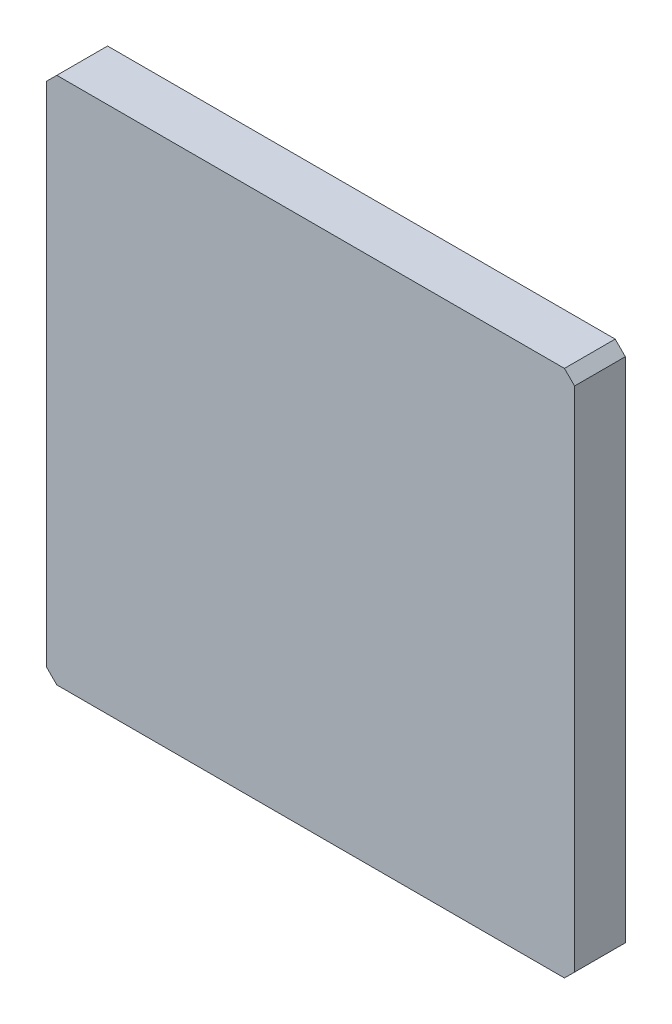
ISO-10303-21;
HEADER;
FILE_DESCRIPTION(('STEP AP214'),'2;1');
FILE_NAME('part.step','',(''),(''),'','','');
FILE_SCHEMA(('AUTOMOTIVE_DESIGN { 1 0 10303 214 1 1 1 1 }'));
ENDSEC;
DATA;
#1=APPLICATION_CONTEXT('core data for automotive mechanical design processes');
#2=APPLICATION_PROTOCOL_DEFINITION('international standard','automotive_design',2000,#1);
#3=PRODUCT_CONTEXT('',#1,'mechanical');
#4=PRODUCT('Part','Part','',(#3));
#5=PRODUCT_RELATED_PRODUCT_CATEGORY('part','',(#4));
#6=PRODUCT_DEFINITION_FORMATION('','',#4);
#7=PRODUCT_DEFINITION_CONTEXT('part definition',#1,'design');
#8=PRODUCT_DEFINITION('design','',#6,#7);
#9=PRODUCT_DEFINITION_SHAPE('','',#8);
#10=(LENGTH_UNIT() NAMED_UNIT(*) SI_UNIT(.MILLI.,.METRE.));
#11=(NAMED_UNIT(*) PLANE_ANGLE_UNIT() SI_UNIT($,.RADIAN.));
#12=(NAMED_UNIT(*) SI_UNIT($,.STERADIAN.) SOLID_ANGLE_UNIT());
#13=UNCERTAINTY_MEASURE_WITH_UNIT(LENGTH_MEASURE(1.E-05),#10,'distance_accuracy_value','');
#14=(GEOMETRIC_REPRESENTATION_CONTEXT(3) GLOBAL_UNCERTAINTY_ASSIGNED_CONTEXT((#13)) GLOBAL_UNIT_ASSIGNED_CONTEXT((#10,
#11,#12)) REPRESENTATION_CONTEXT('',''));
#15=CARTESIAN_POINT('',(0.,0.,0.));
#16=DIRECTION('',(0.,0.,1.));
#17=DIRECTION('',(1.,0.,0.));
#18=AXIS2_PLACEMENT_3D('',#15,#16,#17);
#19=CARTESIAN_POINT('',(2.6,2.6,0.5));
#20=DIRECTION('',(-1.,0.,0.));
#21=DIRECTION('',(0.,-1.,0.));
#22=AXIS2_PLACEMENT_3D('',#19,#20,#21);
#23=PLANE('',#22);
#24=DIRECTION('',(0.,1.,0.));
#25=VECTOR('',#24,1.);
#26=CARTESIAN_POINT('',(2.6,2.6,0.5));
#27=LINE('',#26,#25);
#28=CARTESIAN_POINT('',(2.6,-2.5,0.5));
#29=VERTEX_POINT('',#28);
#30=CARTESIAN_POINT('',(2.6,2.5,0.5));
#31=VERTEX_POINT('',#30);
#32=EDGE_CURVE('E146',#29,#31,#27,.T.);
#33=ORIENTED_EDGE('',*,*,#32,.F.);
#34=DIRECTION('',(0.,0.,-1.));
#35=VECTOR('',#34,1.);
#36=CARTESIAN_POINT('',(2.6,-2.5,0.5));
#37=LINE('',#36,#35);
#38=CARTESIAN_POINT('',(2.6,-2.5,0.));
#39=VERTEX_POINT('',#38);
#40=EDGE_CURVE('E11',#29,#39,#37,.T.);
#41=ORIENTED_EDGE('',*,*,#40,.T.);
#42=DIRECTION('',(0.,1.,0.));
#43=VECTOR('',#42,1.);
#44=CARTESIAN_POINT('',(2.6,2.6,0.));
#45=LINE('',#44,#43);
#46=CARTESIAN_POINT('',(2.6,2.5,0.));
#47=VERTEX_POINT('',#46);
#48=EDGE_CURVE('E192',#39,#47,#45,.T.);
#49=ORIENTED_EDGE('',*,*,#48,.T.);
#50=DIRECTION('',(0.,0.,1.));
#51=VECTOR('',#50,1.);
#52=CARTESIAN_POINT('',(2.6,2.5,0.5));
#53=LINE('',#52,#51);
#54=EDGE_CURVE('E57',#47,#31,#53,.T.);
#55=ORIENTED_EDGE('',*,*,#54,.T.);
#56=EDGE_LOOP('',(#33,#41,#49,#55));
#57=FACE_BOUND('',#56,.T.);
#58=ADVANCED_FACE('F47',(#57),#23,.F.);
#59=CARTESIAN_POINT('',(-2.6,2.6,0.5));
#60=DIRECTION('',(0.,-1.,0.));
#61=DIRECTION('',(0.,0.,-1.));
#62=AXIS2_PLACEMENT_3D('',#59,#60,#61);
#63=PLANE('',#62);
#64=DIRECTION('',(-1.,0.,0.));
#65=VECTOR('',#64,1.);
#66=CARTESIAN_POINT('',(-2.6,2.6,0.));
#67=LINE('',#66,#65);
#68=CARTESIAN_POINT('',(2.5,2.6,0.));
#69=VERTEX_POINT('',#68);
#70=CARTESIAN_POINT('',(-2.5,2.6,0.));
#71=VERTEX_POINT('',#70);
#72=EDGE_CURVE('E153',#69,#71,#67,.T.);
#73=ORIENTED_EDGE('',*,*,#72,.T.);
#74=DIRECTION('',(0.,0.,1.));
#75=VECTOR('',#74,1.);
#76=CARTESIAN_POINT('',(-2.5,2.6,0.5));
#77=LINE('',#76,#75);
#78=CARTESIAN_POINT('',(-2.5,2.6,0.5));
#79=VERTEX_POINT('',#78);
#80=EDGE_CURVE('E64',#71,#79,#77,.T.);
#81=ORIENTED_EDGE('',*,*,#80,.T.);
#82=DIRECTION('',(-1.,0.,0.));
#83=VECTOR('',#82,1.);
#84=CARTESIAN_POINT('',(-2.6,2.6,0.5));
#85=LINE('',#84,#83);
#86=CARTESIAN_POINT('',(2.5,2.6,0.5));
#87=VERTEX_POINT('',#86);
#88=EDGE_CURVE('E151',#87,#79,#85,.T.);
#89=ORIENTED_EDGE('',*,*,#88,.F.);
#90=DIRECTION('',(0.,0.,-1.));
#91=VECTOR('',#90,1.);
#92=CARTESIAN_POINT('',(2.5,2.6,0.5));
#93=LINE('',#92,#91);
#94=EDGE_CURVE('E181',#87,#69,#93,.T.);
#95=ORIENTED_EDGE('',*,*,#94,.T.);
#96=EDGE_LOOP('',(#73,#81,#89,#95));
#97=FACE_BOUND('',#96,.T.);
#98=ADVANCED_FACE('F199',(#97),#63,.F.);
#99=CARTESIAN_POINT('',(-2.6,2.6,0.5));
#100=DIRECTION('',(1.,0.,0.));
#101=DIRECTION('',(0.,1.,0.));
#102=AXIS2_PLACEMENT_3D('',#99,#100,#101);
#103=PLANE('',#102);
#104=DIRECTION('',(0.,-1.,0.));
#105=VECTOR('',#104,1.);
#106=CARTESIAN_POINT('',(-2.6,2.6,0.));
#107=LINE('',#106,#105);
#108=CARTESIAN_POINT('',(-2.6,2.5,0.));
#109=VERTEX_POINT('',#108);
#110=CARTESIAN_POINT('',(-2.6,-2.5,0.));
#111=VERTEX_POINT('',#110);
#112=EDGE_CURVE('E147',#109,#111,#107,.T.);
#113=ORIENTED_EDGE('',*,*,#112,.T.);
#114=DIRECTION('',(0.,0.,1.));
#115=VECTOR('',#114,1.);
#116=CARTESIAN_POINT('',(-2.6,-2.5,0.5));
#117=LINE('',#116,#115);
#118=CARTESIAN_POINT('',(-2.6,-2.5,0.5));
#119=VERTEX_POINT('',#118);
#120=EDGE_CURVE('E121',#111,#119,#117,.T.);
#121=ORIENTED_EDGE('',*,*,#120,.T.);
#122=DIRECTION('',(0.,-1.,0.));
#123=VECTOR('',#122,1.);
#124=CARTESIAN_POINT('',(-2.6,2.6,0.5));
#125=LINE('',#124,#123);
#126=CARTESIAN_POINT('',(-2.6,2.5,0.5));
#127=VERTEX_POINT('',#126);
#128=EDGE_CURVE('E206',#127,#119,#125,.T.);
#129=ORIENTED_EDGE('',*,*,#128,.F.);
#130=DIRECTION('',(0.,0.,-1.));
#131=VECTOR('',#130,1.);
#132=CARTESIAN_POINT('',(-2.6,2.5,0.5));
#133=LINE('',#132,#131);
#134=EDGE_CURVE('E127',#127,#109,#133,.T.);
#135=ORIENTED_EDGE('',*,*,#134,.T.);
#136=EDGE_LOOP('',(#113,#121,#129,#135));
#137=FACE_BOUND('',#136,.T.);
#138=ADVANCED_FACE('F216',(#137),#103,.F.);
#139=CARTESIAN_POINT('',(-2.6,-2.6,0.5));
#140=DIRECTION('',(0.,1.,0.));
#141=DIRECTION('',(0.,0.,1.));
#142=AXIS2_PLACEMENT_3D('',#139,#140,#141);
#143=PLANE('',#142);
#144=DIRECTION('',(1.,0.,0.));
#145=VECTOR('',#144,1.);
#146=CARTESIAN_POINT('',(-2.6,-2.6,0.5));
#147=LINE('',#146,#145);
#148=CARTESIAN_POINT('',(-2.5,-2.6,0.5));
#149=VERTEX_POINT('',#148);
#150=CARTESIAN_POINT('',(2.5,-2.6,0.5));
#151=VERTEX_POINT('',#150);
#152=EDGE_CURVE('E137',#149,#151,#147,.T.);
#153=ORIENTED_EDGE('',*,*,#152,.F.);
#154=DIRECTION('',(0.,0.,-1.));
#155=VECTOR('',#154,1.);
#156=CARTESIAN_POINT('',(-2.5,-2.6,0.5));
#157=LINE('',#156,#155);
#158=CARTESIAN_POINT('',(-2.5,-2.6,0.));
#159=VERTEX_POINT('',#158);
#160=EDGE_CURVE('E120',#149,#159,#157,.T.);
#161=ORIENTED_EDGE('',*,*,#160,.T.);
#162=DIRECTION('',(1.,0.,0.));
#163=VECTOR('',#162,1.);
#164=CARTESIAN_POINT('',(-2.6,-2.6,0.));
#165=LINE('',#164,#163);
#166=CARTESIAN_POINT('',(2.5,-2.6,0.));
#167=VERTEX_POINT('',#166);
#168=EDGE_CURVE('E134',#159,#167,#165,.T.);
#169=ORIENTED_EDGE('',*,*,#168,.T.);
#170=DIRECTION('',(0.,0.,1.));
#171=VECTOR('',#170,1.);
#172=CARTESIAN_POINT('',(2.5,-2.6,0.5));
#173=LINE('',#172,#171);
#174=EDGE_CURVE('E140',#167,#151,#173,.T.);
#175=ORIENTED_EDGE('',*,*,#174,.T.);
#176=EDGE_LOOP('',(#153,#161,#169,#175));
#177=FACE_BOUND('',#176,.T.);
#178=ADVANCED_FACE('F133',(#177),#143,.F.);
#179=CARTESIAN_POINT('',(0.,0.,0.5));
#180=DIRECTION('',(0.,0.,1.));
#181=DIRECTION('',(1.,0.,0.));
#182=AXIS2_PLACEMENT_3D('',#179,#180,#181);
#183=PLANE('',#182);
#184=ORIENTED_EDGE('',*,*,#128,.T.);
#185=DIRECTION('',(-0.707106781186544,0.707106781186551,0.));
#186=VECTOR('',#185,1.);
#187=CARTESIAN_POINT('',(-2.55000000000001,-2.54999999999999,0.5));
#188=LINE('',#187,#186);
#189=EDGE_CURVE('E178',#119,#149,#188,.F.);
#190=ORIENTED_EDGE('',*,*,#189,.T.);
#191=ORIENTED_EDGE('',*,*,#152,.T.);
#192=DIRECTION('',(-0.707106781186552,-0.707106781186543,0.));
#193=VECTOR('',#192,1.);
#194=CARTESIAN_POINT('',(2.54999999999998,-2.55000000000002,0.5));
#195=LINE('',#194,#193);
#196=EDGE_CURVE('E172',#151,#29,#195,.F.);
#197=ORIENTED_EDGE('',*,*,#196,.T.);
#198=ORIENTED_EDGE('',*,*,#32,.T.);
#199=DIRECTION('',(0.707106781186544,-0.707106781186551,0.));
#200=VECTOR('',#199,1.);
#201=CARTESIAN_POINT('',(2.55000000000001,2.54999999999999,0.5));
#202=LINE('',#201,#200);
#203=EDGE_CURVE('E71',#31,#87,#202,.F.);
#204=ORIENTED_EDGE('',*,*,#203,.T.);
#205=ORIENTED_EDGE('',*,*,#88,.T.);
#206=DIRECTION('',(0.707106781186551,0.707106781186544,0.));
#207=VECTOR('',#206,1.);
#208=CARTESIAN_POINT('',(-2.54999999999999,2.55000000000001,0.5));
#209=LINE('',#208,#207);
#210=EDGE_CURVE('E175',#79,#127,#209,.F.);
#211=ORIENTED_EDGE('',*,*,#210,.T.);
#212=EDGE_LOOP('',(#184,#190,#191,#197,#198,#204,#205,#211));
#213=FACE_BOUND('',#212,.T.);
#214=ADVANCED_FACE('F195',(#213),#183,.T.);
#215=CARTESIAN_POINT('',(0.,0.,0.));
#216=DIRECTION('',(0.,0.,1.));
#217=DIRECTION('',(1.,0.,0.));
#218=AXIS2_PLACEMENT_3D('',#215,#216,#217);
#219=PLANE('',#218);
#220=ORIENTED_EDGE('',*,*,#168,.F.);
#221=DIRECTION('',(0.707106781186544,-0.707106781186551,0.));
#222=VECTOR('',#221,1.);
#223=CARTESIAN_POINT('',(-2.5,-2.6,0.));
#224=LINE('',#223,#222);
#225=EDGE_CURVE('E116',#159,#111,#224,.F.);
#226=ORIENTED_EDGE('',*,*,#225,.T.);
#227=ORIENTED_EDGE('',*,*,#112,.F.);
#228=DIRECTION('',(-0.707106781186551,-0.707106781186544,0.));
#229=VECTOR('',#228,1.);
#230=CARTESIAN_POINT('',(-2.6,2.5,0.));
#231=LINE('',#230,#229);
#232=EDGE_CURVE('E128',#109,#71,#231,.F.);
#233=ORIENTED_EDGE('',*,*,#232,.T.);
#234=ORIENTED_EDGE('',*,*,#72,.F.);
#235=DIRECTION('',(-0.707106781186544,0.707106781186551,0.));
#236=VECTOR('',#235,1.);
#237=CARTESIAN_POINT('',(2.5,2.6,0.));
#238=LINE('',#237,#236);
#239=EDGE_CURVE('E139',#69,#47,#238,.F.);
#240=ORIENTED_EDGE('',*,*,#239,.T.);
#241=ORIENTED_EDGE('',*,*,#48,.F.);
#242=DIRECTION('',(0.707106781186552,0.707106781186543,0.));
#243=VECTOR('',#242,1.);
#244=CARTESIAN_POINT('',(2.6,-2.5,0.));
#245=LINE('',#244,#243);
#246=EDGE_CURVE('E144',#39,#167,#245,.F.);
#247=ORIENTED_EDGE('',*,*,#246,.T.);
#248=EDGE_LOOP('',(#220,#226,#227,#233,#234,#240,#241,#247));
#249=FACE_BOUND('',#248,.T.);
#250=ADVANCED_FACE('F142',(#249),#219,.F.);
#251=CARTESIAN_POINT('',(-2.5,-2.6,0.5));
#252=DIRECTION('',(0.707106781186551,0.707106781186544,0.));
#253=DIRECTION('',(0.,0.,-1.));
#254=AXIS2_PLACEMENT_3D('',#251,#252,#253);
#255=PLANE('',#254);
#256=ORIENTED_EDGE('',*,*,#189,.F.);
#257=ORIENTED_EDGE('',*,*,#120,.F.);
#258=ORIENTED_EDGE('',*,*,#225,.F.);
#259=ORIENTED_EDGE('',*,*,#160,.F.);
#260=EDGE_LOOP('',(#256,#257,#258,#259));
#261=FACE_BOUND('',#260,.T.);
#262=ADVANCED_FACE('F119',(#261),#255,.F.);
#263=CARTESIAN_POINT('',(-2.6,2.5,0.5));
#264=DIRECTION('',(0.707106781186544,-0.707106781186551,0.));
#265=DIRECTION('',(0.,0.,-1.));
#266=AXIS2_PLACEMENT_3D('',#263,#264,#265);
#267=PLANE('',#266);
#268=ORIENTED_EDGE('',*,*,#210,.F.);
#269=ORIENTED_EDGE('',*,*,#80,.F.);
#270=ORIENTED_EDGE('',*,*,#232,.F.);
#271=ORIENTED_EDGE('',*,*,#134,.F.);
#272=EDGE_LOOP('',(#268,#269,#270,#271));
#273=FACE_BOUND('',#272,.T.);
#274=ADVANCED_FACE('F214',(#273),#267,.F.);
#275=CARTESIAN_POINT('',(2.6,-2.5,0.5));
#276=DIRECTION('',(-0.707106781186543,0.707106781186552,0.));
#277=DIRECTION('',(0.,0.,-1.));
#278=AXIS2_PLACEMENT_3D('',#275,#276,#277);
#279=PLANE('',#278);
#280=ORIENTED_EDGE('',*,*,#196,.F.);
#281=ORIENTED_EDGE('',*,*,#174,.F.);
#282=ORIENTED_EDGE('',*,*,#246,.F.);
#283=ORIENTED_EDGE('',*,*,#40,.F.);
#284=EDGE_LOOP('',(#280,#281,#282,#283));
#285=FACE_BOUND('',#284,.T.);
#286=ADVANCED_FACE('F218',(#285),#279,.F.);
#287=CARTESIAN_POINT('',(2.5,2.6,0.5));
#288=DIRECTION('',(-0.707106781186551,-0.707106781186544,0.));
#289=DIRECTION('',(0.,0.,-1.));
#290=AXIS2_PLACEMENT_3D('',#287,#288,#289);
#291=PLANE('',#290);
#292=ORIENTED_EDGE('',*,*,#203,.F.);
#293=ORIENTED_EDGE('',*,*,#54,.F.);
#294=ORIENTED_EDGE('',*,*,#239,.F.);
#295=ORIENTED_EDGE('',*,*,#94,.F.);
#296=EDGE_LOOP('',(#292,#293,#294,#295));
#297=FACE_BOUND('',#296,.T.);
#298=ADVANCED_FACE('F50',(#297),#291,.F.);
#299=CLOSED_SHELL('',(#58,#98,#138,#178,#214,#250,#262,#274,#286,#298));
#300=MANIFOLD_SOLID_BREP('B2',#299);
#301=ADVANCED_BREP_SHAPE_REPRESENTATION('',(#18,#300),#14);
#302=SHAPE_DEFINITION_REPRESENTATION(#9,#301);
ENDSEC;
END-ISO-10303-21;
